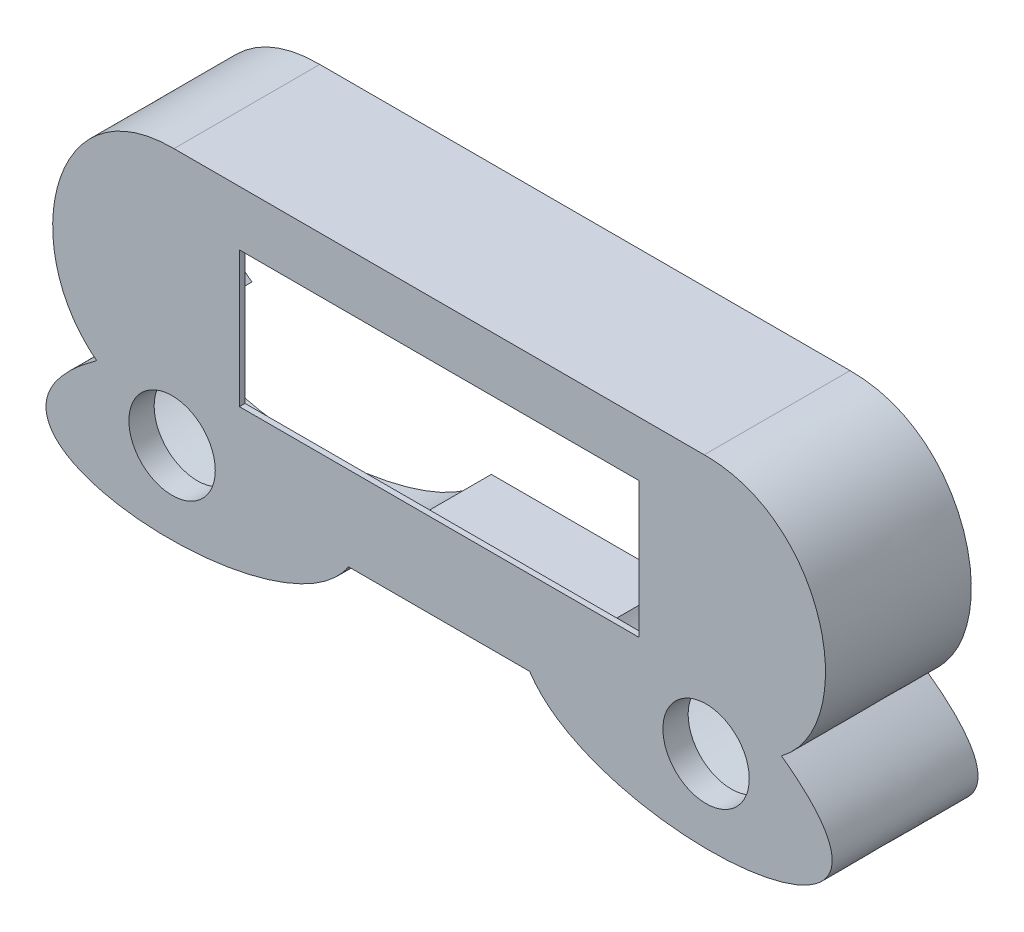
from build123d import *

# Parameters (mm, degrees)
BOSS_EXTRU_2_DEPTH      = 25
BOSS_EXTRU_3_DEPTH      = 1
ESQUISSE3_R             = 7.7
ESQUISSE3_W             = 71.2
ESQUISSE3_H             = 24.2
ENL_V_MAT_EXTRU_1_DEPTH = 10
ESQUISSE4_R             = 8.7
ESQUISSE4_R_2           = 7.7
BOSS_EXTRU_4_DEPTH      = 3.5


with BuildPart() as part:
    # Esquisse1 → Boss.-Extru.2 (new body)
    with BuildSketch(Plane.XY):
        with BuildLine():
            add(Edge.make_bspline(
                [(117.270869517, 60), (139.13403182, 60.174836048), (145.676679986, 31.464675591), (131.040256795, 20.388616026)],
                knots=[0, 0, 0, 0, 1, 1, 1, 1], degree=3))
            add(Edge.make_bspline(
                [(131.040256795, 20.388616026), (163.647555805, -3.002747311), (98.493879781, -7.973687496), (86.139084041, 11)],
                knots=[0, 0, 0, 0, 1, 1, 1, 1], degree=3))
            Line((86.139084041, 11), (53.860915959, 11))
            add(Edge.make_bspline(
                [(8.959743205, 20.388616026), (-23.647555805, -3.002747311), (41.506120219, -7.973687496), (53.860915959, 11)],
                knots=[0, 0, 0, 0, 1, 1, 1, 1], degree=3))
            add(Edge.make_bspline(
                [(22.729130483, 60), (0.86596818, 60.174836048), (-5.676679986, 31.464675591), (8.959743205, 20.388616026)],
                knots=[0, 0, 0, 0, 1, 1, 1, 1], degree=3))
            Line((22.729130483, 60), (117.270869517, 60))
        make_face()
        with BuildLine():
            add(Edge.make_bspline(
                [(129.354661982, 20.367107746), (129.589006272, 20.544446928), (130.061198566, 20.902707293), (130.977553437, 21.590572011), (132.408057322, 22.840575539), (134.180932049, 24.878027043), (135.819471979, 27.619882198), (137.386273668, 31.600496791), (138.186854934, 37.007382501), (137.344662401, 43.603395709), (134.771643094, 49.707292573), (131.267705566, 53.899288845), (127.690755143, 56.447701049), (124.627511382, 57.892887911), (121.74785348, 58.653318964), (119.265968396, 58.959677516), (117.931102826, 59.005247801), (117.274867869, 59)],
                knots=[-6.0958e-05, -6.0958e-05, -6.0958e-05, -6.0958e-05, 0.015950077, 0.031961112, 0.063983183, 0.128027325, 0.192071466, 0.256115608, 0.384203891, 0.512292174, 0.640380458, 0.768468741, 0.832512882, 0.896557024, 0.960601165, 0.992623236, 1.024645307, 1.024645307, 1.024645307, 1.024645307], degree=3))
            Line((117.274867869, 59), (22.725132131, 59))
            add(Edge.make_bspline(
                [(22.725132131, 59), (22.068897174, 59.005247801), (20.734031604, 58.959677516), (18.25214652, 58.653318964), (15.372488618, 57.892887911), (12.309244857, 56.447701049), (8.732294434, 53.899288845), (5.228356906, 49.707292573), (2.655337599, 43.603395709), (1.813145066, 37.007382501), (2.613726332, 31.600496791), (4.180528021, 27.619882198), (5.819067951, 24.878027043), (7.591942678, 22.840575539), (9.022446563, 21.590572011), (9.938801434, 20.902707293), (10.410993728, 20.544446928), (10.645338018, 20.367107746)],
                knots=[-6.0958e-05, -6.0958e-05, -6.0958e-05, -6.0958e-05, 0.031961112, 0.063983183, 0.128027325, 0.192071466, 0.256115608, 0.384203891, 0.512292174, 0.640380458, 0.768468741, 0.832512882, 0.896557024, 0.960601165, 0.992623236, 1.008634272, 1.024645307, 1.024645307, 1.024645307, 1.024645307], degree=3))
            add(Edge.make_bspline(
                [(10.645338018, 20.367107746), (10.130303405, 19.997639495), (9.071078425, 19.246745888), (7.666526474, 18.179132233), (6.399415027, 17.136248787), (4.903940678, 15.792459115), (3.382379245, 14.197575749), (2.084870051, 12.434119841), (1.2762689, 10.837605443), (0.785318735, 8.949374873), (1.065245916, 7.015315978), (2.657911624, 4.914496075), (5.585627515, 3.079004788), (9.603239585, 1.668652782), (16.066094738, 0.420899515), (25.580685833, 0.116578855), (35.382125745, 1.565885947), (42.429709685, 3.794936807), (47.073601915, 5.99456365), (50.212176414, 8.258363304), (51.919713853, 10.041787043), (52.654304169, 10.996353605), (53.018771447, 11.535950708), (53.220374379, 11.848913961), (53.318754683, 12)],
                knots=[-0.011272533, -0.011272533, -0.011272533, -0.011272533, 0.004653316, 0.020579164, 0.036505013, 0.052430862, 0.084282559, 0.116134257, 0.147985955, 0.179837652, 0.243541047, 0.307244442, 0.370947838, 0.434651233, 0.498354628, 0.625761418, 0.753168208, 0.816871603, 0.880574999, 0.944278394, 0.976130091, 0.99205594, 1.000018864, 1.007981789, 1.007981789, 1.007981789, 1.007981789], degree=3))
            Line((53.318754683, 12), (86.681245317, 12))
            add(Edge.make_bspline(
                [(86.681245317, 12), (86.779625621, 11.848913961), (86.981228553, 11.535950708), (87.345695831, 10.996353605), (88.080286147, 10.041787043), (89.787823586, 8.258363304), (92.926398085, 5.99456365), (97.570290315, 3.794936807), (104.617874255, 1.565885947), (114.419314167, 0.116578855), (123.933905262, 0.420899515), (130.396760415, 1.668652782), (134.414372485, 3.079004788), (137.342088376, 4.914496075), (138.934754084, 7.015315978), (139.214681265, 8.949374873), (138.7237311, 10.837605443), (137.915129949, 12.434119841), (136.617620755, 14.197575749), (135.096059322, 15.792459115), (133.600584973, 17.136248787), (132.333473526, 18.179132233), (130.928921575, 19.246745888), (129.869696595, 19.997639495), (129.354661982, 20.367107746)],
                knots=[-0.011272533, -0.011272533, -0.011272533, -0.011272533, -0.003309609, 0.004653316, 0.020579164, 0.052430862, 0.116134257, 0.179837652, 0.243541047, 0.370947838, 0.498354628, 0.562058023, 0.625761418, 0.689464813, 0.753168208, 0.816871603, 0.848723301, 0.880574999, 0.912426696, 0.944278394, 0.960204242, 0.976130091, 0.99205594, 1.007981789, 1.007981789, 1.007981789, 1.007981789], degree=3))
        make_face(mode=Mode.SUBTRACT)
    extrude(amount=BOSS_EXTRU_2_DEPTH)

    # Esquisse2 → Boss.-Extru.3 (add)
    with BuildSketch(Plane.XY.offset(25)):
        with BuildLine():
            Line((117.270869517, 60), (22.729130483, 60))
            add(Edge.make_bspline(
                [(22.729130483, 60), (0.86596818, 60.174836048), (-5.676679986, 31.464675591), (8.959743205, 20.388616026)],
                knots=[0, 0, 0, 0, 1, 1, 1, 1], degree=3))
            add(Edge.make_bspline(
                [(8.959743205, 20.388616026), (-23.647555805, -3.002747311), (41.506120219, -7.973687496), (53.860915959, 11)],
                knots=[0, 0, 0, 0, 1, 1, 1, 1], degree=3))
            Line((53.860915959, 11), (86.139084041, 11))
            add(Edge.make_bspline(
                [(86.139084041, 11), (98.493879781, -7.973687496), (163.647555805, -3.002747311), (131.040256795, 20.388616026)],
                knots=[0, 0, 0, 0, 1, 1, 1, 1], degree=3))
            add(Edge.make_bspline(
                [(131.040256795, 20.388616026), (145.676679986, 31.464675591), (139.13403182, 60.174836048), (117.270869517, 60)],
                knots=[0, 0, 0, 0, 1, 1, 1, 1], degree=3))
        make_face()
    extrude(amount=BOSS_EXTRU_3_DEPTH)

    # Esquisse3 → Enl_v. mat.-Extru.1 (cut)
    with BuildSketch(Plane.XY.offset(26)):
        with Locations((22.4, 14)):
            Circle(ESQUISSE3_R)
        with Locations((117.6, 14)):
            Circle(ESQUISSE3_R)
        with Locations((70, 38.1)):
            Rectangle(ESQUISSE3_W, ESQUISSE3_H)
    extrude(amount=-ENL_V_MAT_EXTRU_1_DEPTH, mode=Mode.SUBTRACT)

    # Esquisse4 → Boss.-Extru.4 (add)
    # profile 1 of 2: a face of its own
    with BuildSketch(Plane(origin=(0, 0, 25), x_dir=(-1, 0, 0), z_dir=(0, 0, -1))):
        with Locations((-117.6, 14)):
            Circle(ESQUISSE4_R)
        with Locations(Location((-117.6, 14, 0), (0, 0, 180))):
            Circle(ESQUISSE4_R_2, mode=Mode.SUBTRACT)
    # profile 2 of 2: a face of its own
    with BuildSketch(Plane(origin=(0, 0, 25), x_dir=(-1, 0, 0), z_dir=(0, 0, -1))):
        with Locations((-22.4, 14)):
            Circle(ESQUISSE4_R)
        with Locations(Location((-22.4, 14, 0), (0, 0, 180))):
            Circle(ESQUISSE4_R_2, mode=Mode.SUBTRACT)
    extrude(amount=BOSS_EXTRU_4_DEPTH)


solid = part.part
